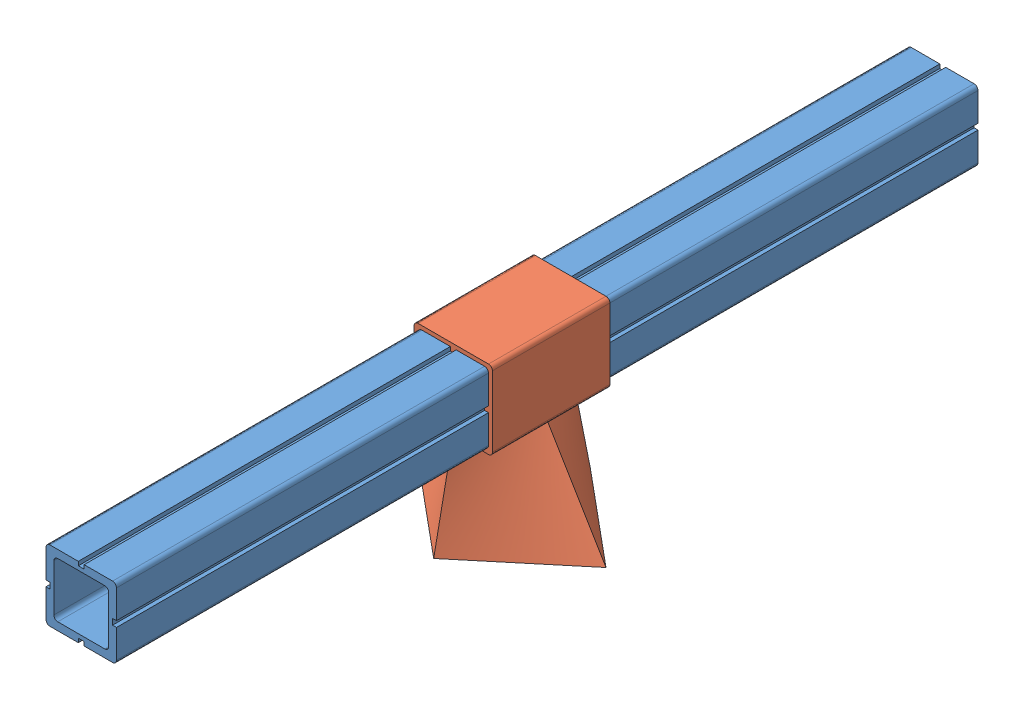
SolidWorks assembly 开垦起垄.SLDASM, configuration 默认 (file format 15000). Lengths in mm.
Overall size (48 45 220).
2 component instances, 2 part files, 2 mates.
Components (placement in the parent):
- 开垦部分1-1: 开垦部分1.SLDPRT [默认] at (-94.542 19.1598 208.6887) size (18 18 220)
- 开垦部分9-1: 开垦部分9.SLDPRT [默认] at (-94.542 19.1598 208.6887) size (48 45 40)
Mates (geometry in assembly coordinates):
- 重合19: coincident anti-aligned: plane of 开垦部分1-1 through (-95.292 11.1598 98.6877) normal (0 -1 0); plane of 开垦部分9-1 through (-94.542 11.1598 223.6887) normal (0 1 0)
- 重合20: coincident anti-aligned: plane of 开垦部分1-1 through (-86.542 18.4098 98.6877) normal (1 0 0); plane of 开垦部分9-1 through (-86.542 19.1598 223.6887) normal (-1 0 0)
